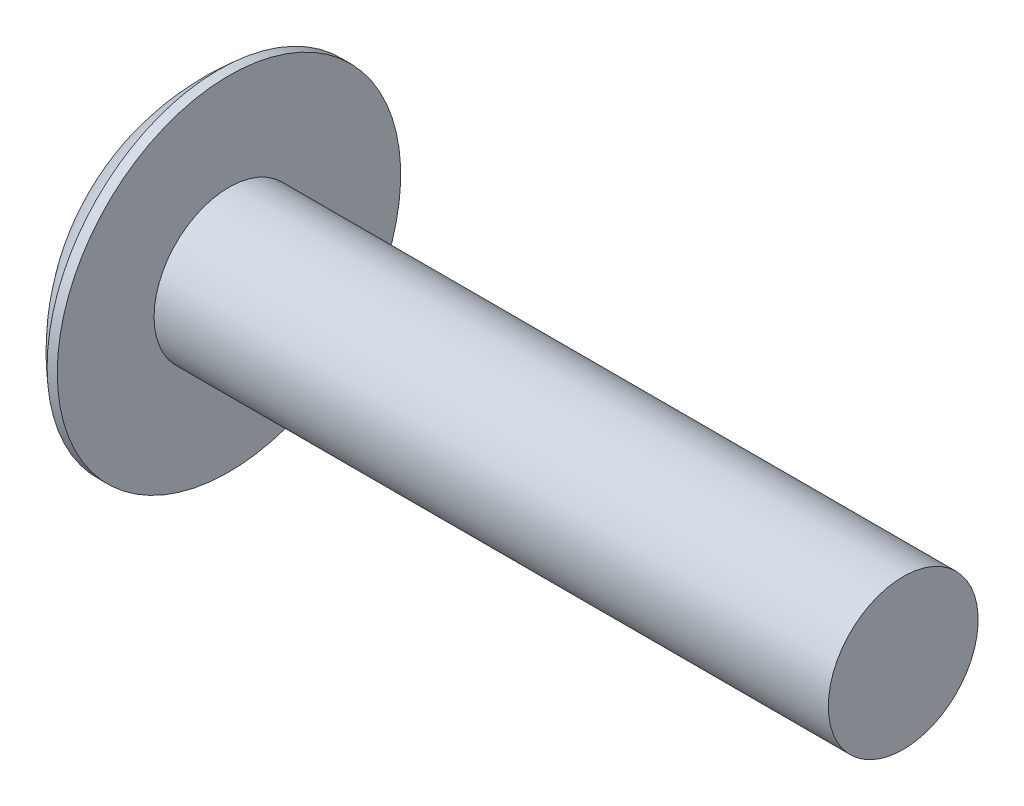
from build123d import *

# Parameters (mm, degrees)
CIRPATTERN1_COUNT = 2
CIRPATTERN1_ANGLE = 90


with BuildPart() as part:
    # BodySke → Base-Revolve (revolve)
    with BuildSketch(Plane.XY, mode=Mode.PRIVATE) as base_revolve_sk:
        with BuildLine():
            Line((3.81, 3.175), (3.81, 7.2771))
            Line((3.81, 7.2771), (3.379315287, 7.2771))
            ThreePointArc((3.379315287, 7.2771), (0.886039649, 4.011731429), (0, 0))
            Line((0, 0), (32.385, 0))
            Line((32.385, 0), (32.385, 3.175))
            Line((32.385, 3.175), (3.81, 3.175))
        make_face()
    revolve(base_revolve_sk.sketch.rotate(Axis((-25.4, 0, 0), (1, 0, 0)), 90), axis=Axis((-25.4, 0, 0), (1, 0, 0)))

    # Sketch3 → Cross section 0
    with BuildSketch(Plane(origin=(0, 0, 0), x_dir=(0, 0, -1), z_dir=(1, 0, 0))):
        with BuildLine():
            Line((0.7239, -4.0767), (-0.7239, -4.0767))
            Line((-0.7239, -4.0767), (-0.7239, 4.0767))
            Line((-0.7239, 4.0767), (0.7239, 4.0767))
            Line((0.7239, 4.0767), (0.7239, -4.0767))
        make_face()
    # Sketch4 → Cross section 1
    with BuildSketch(Plane(origin=(4.6228, 0, 0), x_dir=(0, 0, -1), z_dir=(1, 0, 0))):
        with BuildLine():
            Line((0.36195, -0.36195), (-0.36195, -0.36195))
            Line((-0.36195, -0.36195), (-0.36195, 0.36195))
            Line((-0.36195, 0.36195), (0.36195, 0.36195))
            Line((0.36195, 0.36195), (0.36195, -0.36195))
        make_face()
    cross = loft(mode=Mode.SUBTRACT)

    # CirPattern1: Cross ×2 about axis
    cirpattern1_axis = Axis((0, 0, 0), (1, 0, 0))
    for i in range(1, CIRPATTERN1_COUNT):
        add(cross.rotate(cirpattern1_axis, i * CIRPATTERN1_ANGLE / (CIRPATTERN1_COUNT - 1)), mode=Mode.SUBTRACT)


solid = part.part
